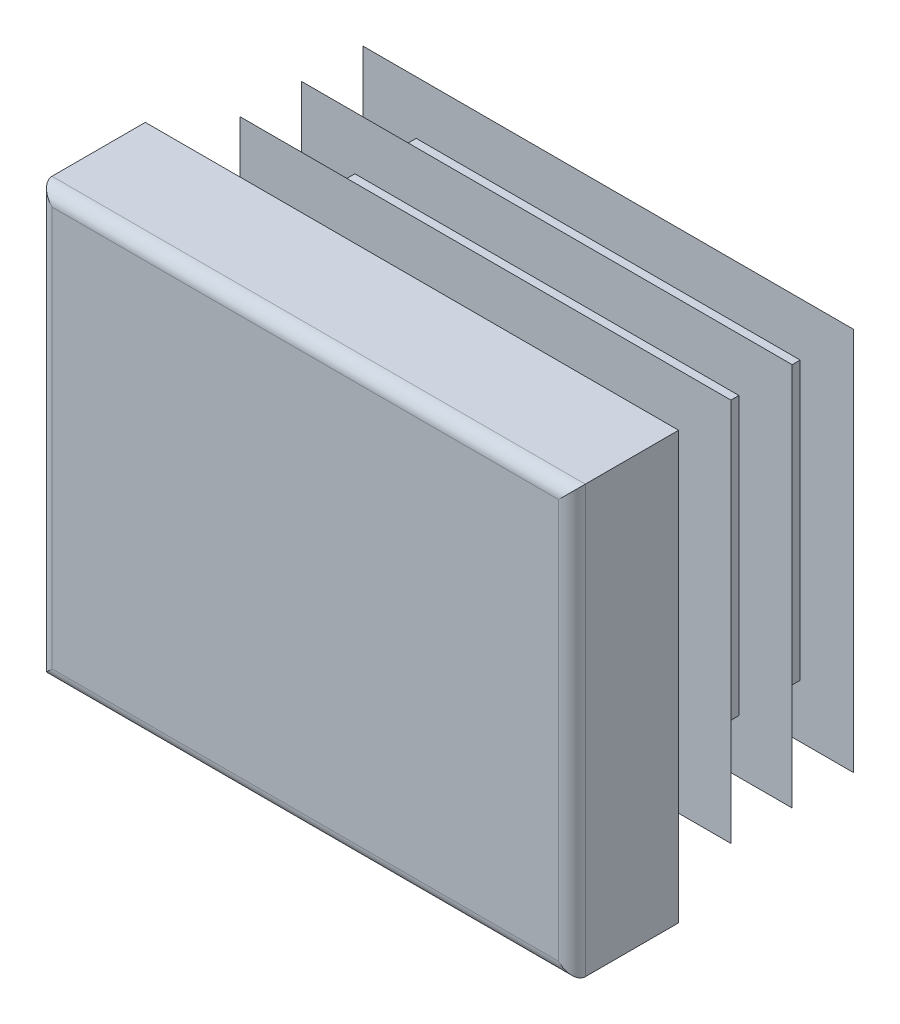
ISO-10303-21;
HEADER;
FILE_DESCRIPTION(('STEP AP214'),'2;1');
FILE_NAME('part.step','',(''),(''),'','','');
FILE_SCHEMA(('AUTOMOTIVE_DESIGN { 1 0 10303 214 1 1 1 1 }'));
ENDSEC;
DATA;
#1=APPLICATION_CONTEXT('core data for automotive mechanical design processes');
#2=APPLICATION_PROTOCOL_DEFINITION('international standard','automotive_design',2000,#1);
#3=PRODUCT_CONTEXT('',#1,'mechanical');
#4=PRODUCT('Part','Part','',(#3));
#5=PRODUCT_RELATED_PRODUCT_CATEGORY('part','',(#4));
#6=PRODUCT_DEFINITION_FORMATION('','',#4);
#7=PRODUCT_DEFINITION_CONTEXT('part definition',#1,'design');
#8=PRODUCT_DEFINITION('design','',#6,#7);
#9=PRODUCT_DEFINITION_SHAPE('','',#8);
#10=(LENGTH_UNIT() NAMED_UNIT(*) SI_UNIT(.MILLI.,.METRE.));
#11=(NAMED_UNIT(*) PLANE_ANGLE_UNIT() SI_UNIT($,.RADIAN.));
#12=(NAMED_UNIT(*) SI_UNIT($,.STERADIAN.) SOLID_ANGLE_UNIT());
#13=UNCERTAINTY_MEASURE_WITH_UNIT(LENGTH_MEASURE(1.E-05),#10,'distance_accuracy_value','');
#14=(GEOMETRIC_REPRESENTATION_CONTEXT(3) GLOBAL_UNCERTAINTY_ASSIGNED_CONTEXT((#13)) GLOBAL_UNIT_ASSIGNED_CONTEXT((#10,
#11,#12)) REPRESENTATION_CONTEXT('',''));
#15=CARTESIAN_POINT('',(0.,0.,0.));
#16=DIRECTION('',(0.,0.,1.));
#17=DIRECTION('',(1.,0.,0.));
#18=AXIS2_PLACEMENT_3D('',#15,#16,#17);
#19=CARTESIAN_POINT('',(11.875,-10.,5.));
#20=DIRECTION('',(0.,0.,-1.));
#21=DIRECTION('',(0.,1.,0.));
#22=AXIS2_PLACEMENT_3D('',#19,#20,#21);
#23=PLANE('',#22);
#24=DIRECTION('',(0.,1.,0.));
#25=VECTOR('',#24,1.);
#26=CARTESIAN_POINT('',(-11.875,-10.,5.));
#27=LINE('',#26,#25);
#28=CARTESIAN_POINT('',(-11.875,-9.375,5.));
#29=VERTEX_POINT('',#28);
#30=CARTESIAN_POINT('',(-11.875,9.375,5.));
#31=VERTEX_POINT('',#30);
#32=EDGE_CURVE('E310',#29,#31,#27,.T.);
#33=ORIENTED_EDGE('',*,*,#32,.F.);
#34=DIRECTION('',(-1.,0.,0.));
#35=VECTOR('',#34,1.);
#36=CARTESIAN_POINT('',(12.5,-9.375,5.));
#37=LINE('',#36,#35);
#38=CARTESIAN_POINT('',(11.875,-9.375,5.));
#39=VERTEX_POINT('',#38);
#40=EDGE_CURVE('E482',#39,#29,#37,.T.);
#41=ORIENTED_EDGE('',*,*,#40,.F.);
#42=DIRECTION('',(0.,1.,0.));
#43=VECTOR('',#42,1.);
#44=CARTESIAN_POINT('',(11.875,-10.,5.));
#45=LINE('',#44,#43);
#46=CARTESIAN_POINT('',(11.875,9.375,5.));
#47=VERTEX_POINT('',#46);
#48=EDGE_CURVE('E305',#39,#47,#45,.T.);
#49=ORIENTED_EDGE('',*,*,#48,.T.);
#50=DIRECTION('',(-1.,0.,0.));
#51=VECTOR('',#50,1.);
#52=CARTESIAN_POINT('',(12.5,9.375,5.));
#53=LINE('',#52,#51);
#54=EDGE_CURVE('E630',#47,#31,#53,.T.);
#55=ORIENTED_EDGE('',*,*,#54,.T.);
#56=EDGE_LOOP('',(#33,#41,#49,#55));
#57=FACE_BOUND('',#56,.T.);
#58=ADVANCED_FACE('F14',(#57),#23,.F.);
#59=CARTESIAN_POINT('',(-11.875,-10.,4.375));
#60=DIRECTION('',(0.,1.,0.));
#61=DIRECTION('',(-1.,0.,0.));
#62=AXIS2_PLACEMENT_3D('',#59,#60,#61);
#63=CYLINDRICAL_SURFACE('',#62,0.625);
#64=DIRECTION('',(0.,1.,0.));
#65=VECTOR('',#64,1.);
#66=CARTESIAN_POINT('',(-12.5,-10.,4.375));
#67=LINE('',#66,#65);
#68=CARTESIAN_POINT('',(-12.5,-10.,4.375));
#69=VERTEX_POINT('',#68);
#70=CARTESIAN_POINT('',(-12.5,10.,4.375));
#71=VERTEX_POINT('',#70);
#72=EDGE_CURVE('E402',#69,#71,#67,.T.);
#73=ORIENTED_EDGE('',*,*,#72,.F.);
#74=CARTESIAN_POINT('',(-11.875,-9.375,4.375));
#75=DIRECTION('',(-0.707106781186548,0.707106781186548,0.));
#76=DIRECTION('',(0.707106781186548,0.707106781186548,0.));
#77=AXIS2_PLACEMENT_3D('',#74,#75,#76);
#78=ELLIPSE('',#77,0.883883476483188,0.625);
#79=EDGE_CURVE('E59',#69,#29,#78,.T.);
#80=ORIENTED_EDGE('',*,*,#79,.T.);
#81=ORIENTED_EDGE('',*,*,#32,.T.);
#82=CARTESIAN_POINT('',(-11.875,9.375,4.375));
#83=DIRECTION('',(0.707106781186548,0.707106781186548,0.));
#84=DIRECTION('',(-0.707106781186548,0.707106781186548,0.));
#85=AXIS2_PLACEMENT_3D('',#82,#83,#84);
#86=ELLIPSE('',#85,0.883883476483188,0.625);
#87=EDGE_CURVE('E306',#31,#71,#86,.F.);
#88=ORIENTED_EDGE('',*,*,#87,.T.);
#89=EDGE_LOOP('',(#73,#80,#81,#88));
#90=FACE_BOUND('',#89,.T.);
#91=ADVANCED_FACE('F16',(#90),#63,.T.);
#92=CARTESIAN_POINT('',(-12.5,-10.,4.375));
#93=DIRECTION('',(1.,0.,0.));
#94=DIRECTION('',(0.,1.,0.));
#95=AXIS2_PLACEMENT_3D('',#92,#93,#94);
#96=PLANE('',#95);
#97=DIRECTION('',(0.,0.,-1.));
#98=VECTOR('',#97,1.);
#99=CARTESIAN_POINT('',(-12.5,10.,4.375));
#100=LINE('',#99,#98);
#101=CARTESIAN_POINT('',(-12.5,10.,0.));
#102=VERTEX_POINT('',#101);
#103=EDGE_CURVE('E615',#71,#102,#100,.T.);
#104=ORIENTED_EDGE('',*,*,#103,.T.);
#105=DIRECTION('',(0.,1.,0.));
#106=VECTOR('',#105,1.);
#107=CARTESIAN_POINT('',(-12.5,-10.,0.));
#108=LINE('',#107,#106);
#109=CARTESIAN_POINT('',(-12.5,-10.,0.));
#110=VERTEX_POINT('',#109);
#111=EDGE_CURVE('E400',#110,#102,#108,.T.);
#112=ORIENTED_EDGE('',*,*,#111,.F.);
#113=DIRECTION('',(0.,0.,-1.));
#114=VECTOR('',#113,1.);
#115=CARTESIAN_POINT('',(-12.5,-10.,4.375));
#116=LINE('',#115,#114);
#117=EDGE_CURVE('E616',#69,#110,#116,.T.);
#118=ORIENTED_EDGE('',*,*,#117,.F.);
#119=ORIENTED_EDGE('',*,*,#72,.T.);
#120=EDGE_LOOP('',(#104,#112,#118,#119));
#121=FACE_BOUND('',#120,.T.);
#122=ADVANCED_FACE('F697',(#121),#96,.F.);
#123=CARTESIAN_POINT('',(-9.,-10.,0.));
#124=DIRECTION('',(1.,0.,0.));
#125=DIRECTION('',(0.,1.,0.));
#126=AXIS2_PLACEMENT_3D('',#123,#124,#125);
#127=PLANE('',#126);
#128=DIRECTION('',(0.,1.,0.));
#129=VECTOR('',#128,1.);
#130=CARTESIAN_POINT('',(-9.,-10.,0.));
#131=LINE('',#130,#129);
#132=CARTESIAN_POINT('',(-9.,-6.5,0.));
#133=VERTEX_POINT('',#132);
#134=CARTESIAN_POINT('',(-9.,6.5,0.));
#135=VERTEX_POINT('',#134);
#136=EDGE_CURVE('E397',#133,#135,#131,.T.);
#137=ORIENTED_EDGE('',*,*,#136,.T.);
#138=DIRECTION('',(0.,0.,-1.));
#139=VECTOR('',#138,1.);
#140=CARTESIAN_POINT('',(-9.,6.5,0.));
#141=LINE('',#140,#139);
#142=CARTESIAN_POINT('',(-9.,6.5,-0.575));
#143=VERTEX_POINT('',#142);
#144=EDGE_CURVE('E495',#135,#143,#141,.T.);
#145=ORIENTED_EDGE('',*,*,#144,.T.);
#146=DIRECTION('',(0.,1.,0.));
#147=VECTOR('',#146,1.);
#148=CARTESIAN_POINT('',(-9.,-10.,-0.575));
#149=LINE('',#148,#147);
#150=CARTESIAN_POINT('',(-9.,-6.5,-0.575));
#151=VERTEX_POINT('',#150);
#152=EDGE_CURVE('E394',#151,#143,#149,.T.);
#153=ORIENTED_EDGE('',*,*,#152,.F.);
#154=DIRECTION('',(0.,0.,1.));
#155=VECTOR('',#154,1.);
#156=CARTESIAN_POINT('',(-9.,-6.5,0.));
#157=LINE('',#156,#155);
#158=EDGE_CURVE('E489',#151,#133,#157,.T.);
#159=ORIENTED_EDGE('',*,*,#158,.T.);
#160=EDGE_LOOP('',(#137,#145,#153,#159));
#161=FACE_BOUND('',#160,.T.);
#162=ADVANCED_FACE('F787',(#161),#127,.F.);
#163=CARTESIAN_POINT('',(-11.5,-10.,-0.575));
#164=DIRECTION('',(0.342020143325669,0.,0.939692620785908));
#165=DIRECTION('',(-0.939692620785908,0.,0.342020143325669));
#166=AXIS2_PLACEMENT_3D('',#163,#164,#165);
#167=PLANE('',#166);
#168=DIRECTION('',(0.,1.,0.));
#169=VECTOR('',#168,1.);
#170=CARTESIAN_POINT('',(-11.5,-10.,-0.575));
#171=LINE('',#170,#169);
#172=CARTESIAN_POINT('',(-11.5,-9.,-0.575));
#173=VERTEX_POINT('',#172);
#174=CARTESIAN_POINT('',(-11.5,9.,-0.575));
#175=VERTEX_POINT('',#174);
#176=EDGE_CURVE('E392',#173,#175,#171,.T.);
#177=ORIENTED_EDGE('',*,*,#176,.T.);
#178=DIRECTION('',(0.844349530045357,-0.438895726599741,-0.307318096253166));
#179=VECTOR('',#178,1.);
#180=CARTESIAN_POINT('',(-4.45895339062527,5.34004028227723,-3.13773138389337));
#181=LINE('',#180,#179);
#182=CARTESIAN_POINT('',(-9.,7.70049158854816,-1.48492558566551));
#183=VERTEX_POINT('',#182);
#184=EDGE_CURVE('E519',#175,#183,#181,.T.);
#185=ORIENTED_EDGE('',*,*,#184,.T.);
#186=DIRECTION('',(0.,1.,0.));
#187=VECTOR('',#186,1.);
#188=CARTESIAN_POINT('',(-9.,-10.,-1.48492558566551));
#189=LINE('',#188,#187);
#190=CARTESIAN_POINT('',(-9.,-7.70049158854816,-1.48492558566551));
#191=VERTEX_POINT('',#190);
#192=EDGE_CURVE('E389',#191,#183,#189,.T.);
#193=ORIENTED_EDGE('',*,*,#192,.F.);
#194=DIRECTION('',(-0.844349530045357,-0.438895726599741,0.307318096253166));
#195=VECTOR('',#194,1.);
#196=CARTESIAN_POINT('',(-11.8705814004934,-9.19262945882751,-0.440119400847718));
#197=LINE('',#196,#195);
#198=EDGE_CURVE('E507',#191,#173,#197,.T.);
#199=ORIENTED_EDGE('',*,*,#198,.T.);
#200=EDGE_LOOP('',(#177,#185,#193,#199));
#201=FACE_BOUND('',#200,.T.);
#202=ADVANCED_FACE('F783',(#201),#167,.F.);
#203=CARTESIAN_POINT('',(-9.,-10.,-1.48492558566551));
#204=DIRECTION('',(1.,0.,0.));
#205=DIRECTION('',(0.,1.,0.));
#206=AXIS2_PLACEMENT_3D('',#203,#204,#205);
#207=PLANE('',#206);
#208=ORIENTED_EDGE('',*,*,#192,.T.);
#209=DIRECTION('',(0.,-0.819152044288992,-0.573576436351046));
#210=VECTOR('',#209,1.);
#211=CARTESIAN_POINT('',(-9.,-4.17671654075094,-9.80143625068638));
#212=LINE('',#211,#210);
#213=CARTESIAN_POINT('',(-9.,6.5,-2.32551884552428));
#214=VERTEX_POINT('',#213);
#215=EDGE_CURVE('E516',#183,#214,#212,.T.);
#216=ORIENTED_EDGE('',*,*,#215,.T.);
#217=DIRECTION('',(0.,0.,-1.));
#218=VECTOR('',#217,1.);
#219=CARTESIAN_POINT('',(-9.,6.5,-1.48492558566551));
#220=LINE('',#219,#218);
#221=CARTESIAN_POINT('',(-9.,6.5,-3.45));
#222=VERTEX_POINT('',#221);
#223=EDGE_CURVE('E525',#214,#222,#220,.T.);
#224=ORIENTED_EDGE('',*,*,#223,.T.);
#225=DIRECTION('',(0.,1.,0.));
#226=VECTOR('',#225,1.);
#227=CARTESIAN_POINT('',(-9.,-10.,-3.45));
#228=LINE('',#227,#226);
#229=CARTESIAN_POINT('',(-9.,-6.5,-3.45));
#230=VERTEX_POINT('',#229);
#231=EDGE_CURVE('E386',#230,#222,#228,.T.);
#232=ORIENTED_EDGE('',*,*,#231,.F.);
#233=DIRECTION('',(0.,0.,1.));
#234=VECTOR('',#233,1.);
#235=CARTESIAN_POINT('',(-9.,-6.5,-1.48492558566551));
#236=LINE('',#235,#234);
#237=CARTESIAN_POINT('',(-9.,-6.5,-2.32551884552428));
#238=VERTEX_POINT('',#237);
#239=EDGE_CURVE('E522',#230,#238,#236,.T.);
#240=ORIENTED_EDGE('',*,*,#239,.T.);
#241=DIRECTION('',(0.,-0.819152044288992,0.573576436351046));
#242=VECTOR('',#241,1.);
#243=CARTESIAN_POINT('',(-9.,-9.24348489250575,-0.404510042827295));
#244=LINE('',#243,#242);
#245=EDGE_CURVE('E504',#238,#191,#244,.T.);
#246=ORIENTED_EDGE('',*,*,#245,.T.);
#247=EDGE_LOOP('',(#208,#216,#224,#232,#240,#246));
#248=FACE_BOUND('',#247,.T.);
#249=ADVANCED_FACE('F779',(#248),#207,.F.);
#250=CARTESIAN_POINT('',(-11.5,-10.,-3.45));
#251=DIRECTION('',(0.342020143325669,0.,0.939692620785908));
#252=DIRECTION('',(-0.939692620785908,0.,0.342020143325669));
#253=AXIS2_PLACEMENT_3D('',#250,#251,#252);
#254=PLANE('',#253);
#255=DIRECTION('',(0.,1.,0.));
#256=VECTOR('',#255,1.);
#257=CARTESIAN_POINT('',(-11.5,-10.,-3.45));
#258=LINE('',#257,#256);
#259=CARTESIAN_POINT('',(-11.5,-9.,-3.45));
#260=VERTEX_POINT('',#259);
#261=CARTESIAN_POINT('',(-11.5,9.,-3.45));
#262=VERTEX_POINT('',#261);
#263=EDGE_CURVE('E384',#260,#262,#258,.T.);
#264=ORIENTED_EDGE('',*,*,#263,.T.);
#265=DIRECTION('',(0.844349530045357,-0.438895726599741,-0.307318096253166));
#266=VECTOR('',#265,1.);
#267=CARTESIAN_POINT('',(-4.45895339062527,5.34004028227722,-6.01273138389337));
#268=LINE('',#267,#266);
#269=CARTESIAN_POINT('',(-9.,7.70049158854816,-4.35992558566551));
#270=VERTEX_POINT('',#269);
#271=EDGE_CURVE('E549',#262,#270,#268,.T.);
#272=ORIENTED_EDGE('',*,*,#271,.T.);
#273=DIRECTION('',(0.,1.,0.));
#274=VECTOR('',#273,1.);
#275=CARTESIAN_POINT('',(-9.,-10.,-4.35992558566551));
#276=LINE('',#275,#274);
#277=CARTESIAN_POINT('',(-9.,-7.70049158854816,-4.35992558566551));
#278=VERTEX_POINT('',#277);
#279=EDGE_CURVE('E381',#278,#270,#276,.T.);
#280=ORIENTED_EDGE('',*,*,#279,.F.);
#281=DIRECTION('',(-0.844349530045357,-0.43889572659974,0.307318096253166));
#282=VECTOR('',#281,1.);
#283=CARTESIAN_POINT('',(-11.8705814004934,-9.19262945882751,-3.31511940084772));
#284=LINE('',#283,#282);
#285=EDGE_CURVE('E537',#278,#260,#284,.T.);
#286=ORIENTED_EDGE('',*,*,#285,.T.);
#287=EDGE_LOOP('',(#264,#272,#280,#286));
#288=FACE_BOUND('',#287,.T.);
#289=ADVANCED_FACE('F775',(#288),#254,.F.);
#290=CARTESIAN_POINT('',(-9.,-10.,-4.35992558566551));
#291=DIRECTION('',(1.,0.,0.));
#292=DIRECTION('',(0.,1.,0.));
#293=AXIS2_PLACEMENT_3D('',#290,#291,#292);
#294=PLANE('',#293);
#295=ORIENTED_EDGE('',*,*,#279,.T.);
#296=DIRECTION('',(0.,-0.819152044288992,-0.573576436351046));
#297=VECTOR('',#296,1.);
#298=CARTESIAN_POINT('',(-9.,-4.17671654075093,-12.6764362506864));
#299=LINE('',#298,#297);
#300=CARTESIAN_POINT('',(-9.,6.5,-5.20051884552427));
#301=VERTEX_POINT('',#300);
#302=EDGE_CURVE('E546',#270,#301,#299,.T.);
#303=ORIENTED_EDGE('',*,*,#302,.T.);
#304=DIRECTION('',(0.,0.,-1.));
#305=VECTOR('',#304,1.);
#306=CARTESIAN_POINT('',(-9.,6.5,-4.35992558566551));
#307=LINE('',#306,#305);
#308=CARTESIAN_POINT('',(-9.,6.5,-6.325));
#309=VERTEX_POINT('',#308);
#310=EDGE_CURVE('E555',#301,#309,#307,.T.);
#311=ORIENTED_EDGE('',*,*,#310,.T.);
#312=DIRECTION('',(0.,1.,0.));
#313=VECTOR('',#312,1.);
#314=CARTESIAN_POINT('',(-9.,-10.,-6.325));
#315=LINE('',#314,#313);
#316=CARTESIAN_POINT('',(-9.,-6.5,-6.325));
#317=VERTEX_POINT('',#316);
#318=EDGE_CURVE('E378',#317,#309,#315,.T.);
#319=ORIENTED_EDGE('',*,*,#318,.F.);
#320=DIRECTION('',(0.,0.,1.));
#321=VECTOR('',#320,1.);
#322=CARTESIAN_POINT('',(-9.,-6.5,-4.35992558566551));
#323=LINE('',#322,#321);
#324=CARTESIAN_POINT('',(-9.,-6.5,-5.20051884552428));
#325=VERTEX_POINT('',#324);
#326=EDGE_CURVE('E552',#317,#325,#323,.T.);
#327=ORIENTED_EDGE('',*,*,#326,.T.);
#328=DIRECTION('',(0.,-0.819152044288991,0.573576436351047));
#329=VECTOR('',#328,1.);
#330=CARTESIAN_POINT('',(-9.,-9.24348489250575,-3.27951004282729));
#331=LINE('',#330,#329);
#332=EDGE_CURVE('E534',#325,#278,#331,.T.);
#333=ORIENTED_EDGE('',*,*,#332,.T.);
#334=EDGE_LOOP('',(#295,#303,#311,#319,#327,#333));
#335=FACE_BOUND('',#334,.T.);
#336=ADVANCED_FACE('F771',(#335),#294,.F.);
#337=CARTESIAN_POINT('',(-11.5,-10.,-6.325));
#338=DIRECTION('',(0.34202014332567,0.,0.939692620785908));
#339=DIRECTION('',(-0.939692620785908,0.,0.34202014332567));
#340=AXIS2_PLACEMENT_3D('',#337,#338,#339);
#341=PLANE('',#340);
#342=DIRECTION('',(0.,1.,0.));
#343=VECTOR('',#342,1.);
#344=CARTESIAN_POINT('',(-11.5,-10.,-6.325));
#345=LINE('',#344,#343);
#346=CARTESIAN_POINT('',(-11.5,-9.,-6.325));
#347=VERTEX_POINT('',#346);
#348=CARTESIAN_POINT('',(-11.5,9.,-6.325));
#349=VERTEX_POINT('',#348);
#350=EDGE_CURVE('E376',#347,#349,#345,.T.);
#351=ORIENTED_EDGE('',*,*,#350,.T.);
#352=DIRECTION('',(0.844349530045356,-0.438895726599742,-0.307318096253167));
#353=VECTOR('',#352,1.);
#354=CARTESIAN_POINT('',(-4.45895339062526,5.3400402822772,-8.88773138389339));
#355=LINE('',#354,#353);
#356=CARTESIAN_POINT('',(-9.,7.70049158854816,-7.23492558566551));
#357=VERTEX_POINT('',#356);
#358=EDGE_CURVE('E579',#349,#357,#355,.T.);
#359=ORIENTED_EDGE('',*,*,#358,.T.);
#360=DIRECTION('',(0.,1.,0.));
#361=VECTOR('',#360,1.);
#362=CARTESIAN_POINT('',(-9.,-10.,-7.23492558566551));
#363=LINE('',#362,#361);
#364=CARTESIAN_POINT('',(-9.,-7.70049158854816,-7.23492558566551));
#365=VERTEX_POINT('',#364);
#366=EDGE_CURVE('E373',#365,#357,#363,.T.);
#367=ORIENTED_EDGE('',*,*,#366,.F.);
#368=DIRECTION('',(-0.844349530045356,-0.438895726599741,0.307318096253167));
#369=VECTOR('',#368,1.);
#370=CARTESIAN_POINT('',(-11.8705814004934,-9.19262945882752,-6.19011940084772));
#371=LINE('',#370,#369);
#372=EDGE_CURVE('E567',#365,#347,#371,.T.);
#373=ORIENTED_EDGE('',*,*,#372,.T.);
#374=EDGE_LOOP('',(#351,#359,#367,#373));
#375=FACE_BOUND('',#374,.T.);
#376=ADVANCED_FACE('F767',(#375),#341,.F.);
#377=CARTESIAN_POINT('',(-9.,-10.,-7.23492558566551));
#378=DIRECTION('',(1.,0.,0.));
#379=DIRECTION('',(0.,1.,0.));
#380=AXIS2_PLACEMENT_3D('',#377,#378,#379);
#381=PLANE('',#380);
#382=ORIENTED_EDGE('',*,*,#366,.T.);
#383=DIRECTION('',(0.,-0.819152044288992,-0.573576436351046));
#384=VECTOR('',#383,1.);
#385=CARTESIAN_POINT('',(-9.,-4.17671654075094,-15.5514362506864));
#386=LINE('',#385,#384);
#387=CARTESIAN_POINT('',(-9.,6.5,-8.07551884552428));
#388=VERTEX_POINT('',#387);
#389=EDGE_CURVE('E576',#357,#388,#386,.T.);
#390=ORIENTED_EDGE('',*,*,#389,.T.);
#391=DIRECTION('',(0.,0.,-1.));
#392=VECTOR('',#391,1.);
#393=CARTESIAN_POINT('',(-9.,6.5,-7.23492558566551));
#394=LINE('',#393,#392);
#395=CARTESIAN_POINT('',(-9.,6.5,-9.2));
#396=VERTEX_POINT('',#395);
#397=EDGE_CURVE('E585',#388,#396,#394,.T.);
#398=ORIENTED_EDGE('',*,*,#397,.T.);
#399=DIRECTION('',(0.,1.,0.));
#400=VECTOR('',#399,1.);
#401=CARTESIAN_POINT('',(-9.,-10.,-9.2));
#402=LINE('',#401,#400);
#403=CARTESIAN_POINT('',(-9.,-6.5,-9.2));
#404=VERTEX_POINT('',#403);
#405=EDGE_CURVE('E370',#404,#396,#402,.T.);
#406=ORIENTED_EDGE('',*,*,#405,.F.);
#407=DIRECTION('',(0.,0.,1.));
#408=VECTOR('',#407,1.);
#409=CARTESIAN_POINT('',(-9.,-6.5,-7.23492558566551));
#410=LINE('',#409,#408);
#411=CARTESIAN_POINT('',(-9.,-6.5,-8.07551884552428));
#412=VERTEX_POINT('',#411);
#413=EDGE_CURVE('E582',#404,#412,#410,.T.);
#414=ORIENTED_EDGE('',*,*,#413,.T.);
#415=DIRECTION('',(0.,-0.819152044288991,0.573576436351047));
#416=VECTOR('',#415,1.);
#417=CARTESIAN_POINT('',(-9.,-9.24348489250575,-6.1545100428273));
#418=LINE('',#417,#416);
#419=EDGE_CURVE('E564',#412,#365,#418,.T.);
#420=ORIENTED_EDGE('',*,*,#419,.T.);
#421=EDGE_LOOP('',(#382,#390,#398,#406,#414,#420));
#422=FACE_BOUND('',#421,.T.);
#423=ADVANCED_FACE('F764',(#422),#381,.F.);
#424=CARTESIAN_POINT('',(-11.5,-10.,-9.2));
#425=DIRECTION('',(0.342020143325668,0.,0.939692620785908));
#426=DIRECTION('',(-0.939692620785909,0.,0.342020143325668));
#427=AXIS2_PLACEMENT_3D('',#424,#425,#426);
#428=PLANE('',#427);
#429=DIRECTION('',(0.,1.,0.));
#430=VECTOR('',#429,1.);
#431=CARTESIAN_POINT('',(-11.5,-10.,-9.2));
#432=LINE('',#431,#430);
#433=CARTESIAN_POINT('',(-11.5,-9.,-9.2));
#434=VERTEX_POINT('',#433);
#435=CARTESIAN_POINT('',(-11.5,9.,-9.2));
#436=VERTEX_POINT('',#435);
#437=EDGE_CURVE('E368',#434,#436,#432,.T.);
#438=ORIENTED_EDGE('',*,*,#437,.T.);
#439=DIRECTION('',(0.844349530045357,-0.438895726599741,-0.307318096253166));
#440=VECTOR('',#439,1.);
#441=CARTESIAN_POINT('',(-4.45895339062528,5.34004028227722,-11.7627313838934));
#442=LINE('',#441,#440);
#443=CARTESIAN_POINT('',(-9.,7.70049158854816,-10.1099255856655));
#444=VERTEX_POINT('',#443);
#445=EDGE_CURVE('E607',#436,#444,#442,.T.);
#446=ORIENTED_EDGE('',*,*,#445,.T.);
#447=DIRECTION('',(0.,1.,0.));
#448=VECTOR('',#447,1.);
#449=CARTESIAN_POINT('',(-9.,-10.,-10.1099255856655));
#450=LINE('',#449,#448);
#451=CARTESIAN_POINT('',(-9.,-7.70049158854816,-10.1099255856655));
#452=VERTEX_POINT('',#451);
#453=EDGE_CURVE('E365',#452,#444,#450,.T.);
#454=ORIENTED_EDGE('',*,*,#453,.F.);
#455=DIRECTION('',(-0.844349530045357,-0.43889572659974,0.307318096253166));
#456=VECTOR('',#455,1.);
#457=CARTESIAN_POINT('',(-11.8705814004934,-9.19262945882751,-9.06511940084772));
#458=LINE('',#457,#456);
#459=EDGE_CURVE('E595',#452,#434,#458,.T.);
#460=ORIENTED_EDGE('',*,*,#459,.T.);
#461=EDGE_LOOP('',(#438,#446,#454,#460));
#462=FACE_BOUND('',#461,.T.);
#463=ADVANCED_FACE('F675',(#462),#428,.F.);
#464=CARTESIAN_POINT('',(-9.,-10.,-10.1099255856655));
#465=DIRECTION('',(1.,0.,0.));
#466=DIRECTION('',(0.,1.,0.));
#467=AXIS2_PLACEMENT_3D('',#464,#465,#466);
#468=PLANE('',#467);
#469=ORIENTED_EDGE('',*,*,#453,.T.);
#470=DIRECTION('',(0.,-0.819152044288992,-0.573576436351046));
#471=VECTOR('',#470,1.);
#472=CARTESIAN_POINT('',(-9.,-4.17671654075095,-18.4264362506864));
#473=LINE('',#472,#471);
#474=CARTESIAN_POINT('',(-9.,6.5,-10.9505188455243));
#475=VERTEX_POINT('',#474);
#476=EDGE_CURVE('E604',#444,#475,#473,.T.);
#477=ORIENTED_EDGE('',*,*,#476,.T.);
#478=DIRECTION('',(0.,0.,-1.));
#479=VECTOR('',#478,1.);
#480=CARTESIAN_POINT('',(-9.,6.5,-10.1099255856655));
#481=LINE('',#480,#479);
#482=CARTESIAN_POINT('',(-9.,6.5,-11.5));
#483=VERTEX_POINT('',#482);
#484=EDGE_CURVE('E613',#475,#483,#481,.T.);
#485=ORIENTED_EDGE('',*,*,#484,.T.);
#486=DIRECTION('',(0.,1.,0.));
#487=VECTOR('',#486,1.);
#488=CARTESIAN_POINT('',(-9.,-10.,-11.5));
#489=LINE('',#488,#487);
#490=CARTESIAN_POINT('',(-9.,-6.5,-11.5));
#491=VERTEX_POINT('',#490);
#492=EDGE_CURVE('E362',#491,#483,#489,.T.);
#493=ORIENTED_EDGE('',*,*,#492,.F.);
#494=DIRECTION('',(0.,0.,1.));
#495=VECTOR('',#494,1.);
#496=CARTESIAN_POINT('',(-9.,-6.5,-10.1099255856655));
#497=LINE('',#496,#495);
#498=CARTESIAN_POINT('',(-9.,-6.5,-10.9505188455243));
#499=VERTEX_POINT('',#498);
#500=EDGE_CURVE('E610',#491,#499,#497,.T.);
#501=ORIENTED_EDGE('',*,*,#500,.T.);
#502=DIRECTION('',(0.,-0.819152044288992,0.573576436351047));
#503=VECTOR('',#502,1.);
#504=CARTESIAN_POINT('',(-9.,-9.24348489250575,-9.02951004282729));
#505=LINE('',#504,#503);
#506=EDGE_CURVE('E592',#499,#452,#505,.T.);
#507=ORIENTED_EDGE('',*,*,#506,.T.);
#508=EDGE_LOOP('',(#469,#477,#485,#493,#501,#507));
#509=FACE_BOUND('',#508,.T.);
#510=ADVANCED_FACE('F677',(#509),#468,.F.);
#511=CARTESIAN_POINT('',(-9.,-10.,-11.5));
#512=DIRECTION('',(0.,0.,1.));
#513=DIRECTION('',(0.,-1.,0.));
#514=AXIS2_PLACEMENT_3D('',#511,#512,#513);
#515=PLANE('',#514);
#516=ORIENTED_EDGE('',*,*,#492,.T.);
#517=DIRECTION('',(-1.,0.,0.));
#518=VECTOR('',#517,1.);
#519=CARTESIAN_POINT('',(12.5,6.5,-11.5));
#520=LINE('',#519,#518);
#521=CARTESIAN_POINT('',(9.,6.5,-11.5));
#522=VERTEX_POINT('',#521);
#523=EDGE_CURVE('E438',#522,#483,#520,.T.);
#524=ORIENTED_EDGE('',*,*,#523,.F.);
#525=DIRECTION('',(0.,1.,0.));
#526=VECTOR('',#525,1.);
#527=CARTESIAN_POINT('',(9.,-10.,-11.5));
#528=LINE('',#527,#526);
#529=CARTESIAN_POINT('',(9.,-6.5,-11.5));
#530=VERTEX_POINT('',#529);
#531=EDGE_CURVE('E359',#530,#522,#528,.T.);
#532=ORIENTED_EDGE('',*,*,#531,.F.);
#533=DIRECTION('',(-1.,0.,0.));
#534=VECTOR('',#533,1.);
#535=CARTESIAN_POINT('',(12.5,-6.5,-11.5));
#536=LINE('',#535,#534);
#537=EDGE_CURVE('E436',#530,#491,#536,.T.);
#538=ORIENTED_EDGE('',*,*,#537,.T.);
#539=EDGE_LOOP('',(#516,#524,#532,#538));
#540=FACE_BOUND('',#539,.T.);
#541=ADVANCED_FACE('F435',(#540),#515,.F.);
#542=CARTESIAN_POINT('',(9.,-10.,-11.5));
#543=DIRECTION('',(-1.,0.,0.));
#544=DIRECTION('',(0.,-1.,0.));
#545=AXIS2_PLACEMENT_3D('',#542,#543,#544);
#546=PLANE('',#545);
#547=DIRECTION('',(0.,0.,1.));
#548=VECTOR('',#547,1.);
#549=CARTESIAN_POINT('',(9.,6.5,-11.5));
#550=LINE('',#549,#548);
#551=CARTESIAN_POINT('',(9.,6.5,-10.9505188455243));
#552=VERTEX_POINT('',#551);
#553=EDGE_CURVE('E9',#522,#552,#550,.T.);
#554=ORIENTED_EDGE('',*,*,#553,.T.);
#555=DIRECTION('',(0.,0.819152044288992,0.573576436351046));
#556=VECTOR('',#555,1.);
#557=CARTESIAN_POINT('',(9.,-4.82983787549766,-18.8837567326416));
#558=LINE('',#557,#556);
#559=CARTESIAN_POINT('',(9.,7.70049158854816,-10.1099255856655));
#560=VERTEX_POINT('',#559);
#561=EDGE_CURVE('E601',#552,#560,#558,.T.);
#562=ORIENTED_EDGE('',*,*,#561,.T.);
#563=DIRECTION('',(0.,1.,0.));
#564=VECTOR('',#563,1.);
#565=CARTESIAN_POINT('',(9.,-10.,-10.1099255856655));
#566=LINE('',#565,#564);
#567=CARTESIAN_POINT('',(9.,-7.70049158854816,-10.1099255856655));
#568=VERTEX_POINT('',#567);
#569=EDGE_CURVE('E356',#568,#560,#566,.T.);
#570=ORIENTED_EDGE('',*,*,#569,.F.);
#571=DIRECTION('',(0.,0.819152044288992,-0.573576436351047));
#572=VECTOR('',#571,1.);
#573=CARTESIAN_POINT('',(9.,-8.59036355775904,-9.48683052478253));
#574=LINE('',#573,#572);
#575=CARTESIAN_POINT('',(9.,-6.5,-10.9505188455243));
#576=VERTEX_POINT('',#575);
#577=EDGE_CURVE('E428',#568,#576,#574,.T.);
#578=ORIENTED_EDGE('',*,*,#577,.T.);
#579=DIRECTION('',(0.,0.,-1.));
#580=VECTOR('',#579,1.);
#581=CARTESIAN_POINT('',(9.,-6.5,-11.5));
#582=LINE('',#581,#580);
#583=EDGE_CURVE('E23',#576,#530,#582,.T.);
#584=ORIENTED_EDGE('',*,*,#583,.T.);
#585=ORIENTED_EDGE('',*,*,#531,.T.);
#586=EDGE_LOOP('',(#554,#562,#570,#578,#584,#585));
#587=FACE_BOUND('',#586,.T.);
#588=ADVANCED_FACE('F426',(#587),#546,.F.);
#589=CARTESIAN_POINT('',(9.,-10.,-10.1099255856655));
#590=DIRECTION('',(-0.342020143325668,0.,0.939692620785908));
#591=DIRECTION('',(-0.939692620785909,0.,-0.342020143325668));
#592=AXIS2_PLACEMENT_3D('',#589,#590,#591);
#593=PLANE('',#592);
#594=ORIENTED_EDGE('',*,*,#569,.T.);
#595=DIRECTION('',(0.844349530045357,0.438895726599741,0.307318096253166));
#596=VECTOR('',#595,1.);
#597=CARTESIAN_POINT('',(2.44052703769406,4.29085547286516,-12.4973784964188));
#598=LINE('',#597,#596);
#599=CARTESIAN_POINT('',(11.5,9.,-9.2));
#600=VERTEX_POINT('',#599);
#601=EDGE_CURVE('E598',#560,#600,#598,.T.);
#602=ORIENTED_EDGE('',*,*,#601,.T.);
#603=DIRECTION('',(0.,1.,0.));
#604=VECTOR('',#603,1.);
#605=CARTESIAN_POINT('',(11.5,-10.,-9.2));
#606=LINE('',#605,#604);
#607=CARTESIAN_POINT('',(11.5,-9.,-9.2));
#608=VERTEX_POINT('',#607);
#609=EDGE_CURVE('E353',#608,#600,#606,.T.);
#610=ORIENTED_EDGE('',*,*,#609,.F.);
#611=DIRECTION('',(-0.844349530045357,0.43889572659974,-0.307318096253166));
#612=VECTOR('',#611,1.);
#613=CARTESIAN_POINT('',(9.85215504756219,-8.14344464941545,-9.79976651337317));
#614=LINE('',#613,#612);
#615=EDGE_CURVE('E588',#608,#568,#614,.T.);
#616=ORIENTED_EDGE('',*,*,#615,.T.);
#617=EDGE_LOOP('',(#594,#602,#610,#616));
#618=FACE_BOUND('',#617,.T.);
#619=ADVANCED_FACE('F752',(#618),#593,.F.);
#620=CARTESIAN_POINT('',(11.5,-10.,-9.2));
#621=DIRECTION('',(0.,0.,-1.));
#622=DIRECTION('',(0.,1.,0.));
#623=AXIS2_PLACEMENT_3D('',#620,#621,#622);
#624=PLANE('',#623);
#625=ORIENTED_EDGE('',*,*,#609,.T.);
#626=DIRECTION('',(-1.,0.,0.));
#627=VECTOR('',#626,1.);
#628=CARTESIAN_POINT('',(12.5,9.,-9.2));
#629=LINE('',#628,#627);
#630=EDGE_CURVE('E444',#600,#436,#629,.T.);
#631=ORIENTED_EDGE('',*,*,#630,.T.);
#632=ORIENTED_EDGE('',*,*,#437,.F.);
#633=DIRECTION('',(-1.,0.,0.));
#634=VECTOR('',#633,1.);
#635=CARTESIAN_POINT('',(12.5,-9.,-9.2));
#636=LINE('',#635,#634);
#637=EDGE_CURVE('E451',#608,#434,#636,.T.);
#638=ORIENTED_EDGE('',*,*,#637,.F.);
#639=EDGE_LOOP('',(#625,#631,#632,#638));
#640=FACE_BOUND('',#639,.T.);
#641=ORIENTED_EDGE('',*,*,#405,.T.);
#642=DIRECTION('',(-1.,0.,0.));
#643=VECTOR('',#642,1.);
#644=CARTESIAN_POINT('',(12.5,6.5,-9.2));
#645=LINE('',#644,#643);
#646=CARTESIAN_POINT('',(9.,6.5,-9.2));
#647=VERTEX_POINT('',#646);
#648=EDGE_CURVE('E663',#647,#396,#645,.T.);
#649=ORIENTED_EDGE('',*,*,#648,.F.);
#650=DIRECTION('',(0.,1.,0.));
#651=VECTOR('',#650,1.);
#652=CARTESIAN_POINT('',(9.,-10.,-9.2));
#653=LINE('',#652,#651);
#654=CARTESIAN_POINT('',(9.,-6.5,-9.2));
#655=VERTEX_POINT('',#654);
#656=EDGE_CURVE('E350',#655,#647,#653,.T.);
#657=ORIENTED_EDGE('',*,*,#656,.F.);
#658=DIRECTION('',(-1.,0.,0.));
#659=VECTOR('',#658,1.);
#660=CARTESIAN_POINT('',(12.5,-6.5,-9.2));
#661=LINE('',#660,#659);
#662=EDGE_CURVE('E453',#655,#404,#661,.T.);
#663=ORIENTED_EDGE('',*,*,#662,.T.);
#664=EDGE_LOOP('',(#641,#649,#657,#663));
#665=FACE_BOUND('',#664,.T.);
#666=ADVANCED_FACE('F667',(#640,#665),#624,.F.);
#667=CARTESIAN_POINT('',(9.,-10.,-9.2));
#668=DIRECTION('',(-1.,0.,0.));
#669=DIRECTION('',(0.,-1.,0.));
#670=AXIS2_PLACEMENT_3D('',#667,#668,#669);
#671=PLANE('',#670);
#672=DIRECTION('',(0.,0.,1.));
#673=VECTOR('',#672,1.);
#674=CARTESIAN_POINT('',(9.,6.5,-9.2));
#675=LINE('',#674,#673);
#676=CARTESIAN_POINT('',(9.,6.5,-8.07551884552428));
#677=VERTEX_POINT('',#676);
#678=EDGE_CURVE('E420',#647,#677,#675,.T.);
#679=ORIENTED_EDGE('',*,*,#678,.T.);
#680=DIRECTION('',(0.,0.819152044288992,0.573576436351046));
#681=VECTOR('',#680,1.);
#682=CARTESIAN_POINT('',(9.,-5.0999995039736,-16.1979259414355));
#683=LINE('',#682,#681);
#684=CARTESIAN_POINT('',(9.,7.70049158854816,-7.23492558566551));
#685=VERTEX_POINT('',#684);
#686=EDGE_CURVE('E573',#677,#685,#683,.T.);
#687=ORIENTED_EDGE('',*,*,#686,.T.);
#688=DIRECTION('',(0.,1.,0.));
#689=VECTOR('',#688,1.);
#690=CARTESIAN_POINT('',(9.,-10.,-7.23492558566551));
#691=LINE('',#690,#689);
#692=CARTESIAN_POINT('',(9.,-7.70049158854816,-7.23492558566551));
#693=VERTEX_POINT('',#692);
#694=EDGE_CURVE('E347',#693,#685,#691,.T.);
#695=ORIENTED_EDGE('',*,*,#694,.F.);
#696=DIRECTION('',(0.,0.819152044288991,-0.573576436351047));
#697=VECTOR('',#696,1.);
#698=CARTESIAN_POINT('',(9.,-8.32020192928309,-6.8009997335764));
#699=LINE('',#698,#697);
#700=CARTESIAN_POINT('',(9.,-6.5,-8.07551884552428));
#701=VERTEX_POINT('',#700);
#702=EDGE_CURVE('E561',#693,#701,#699,.T.);
#703=ORIENTED_EDGE('',*,*,#702,.T.);
#704=DIRECTION('',(0.,0.,-1.));
#705=VECTOR('',#704,1.);
#706=CARTESIAN_POINT('',(9.,-6.5,-9.2));
#707=LINE('',#706,#705);
#708=EDGE_CURVE('E417',#701,#655,#707,.T.);
#709=ORIENTED_EDGE('',*,*,#708,.T.);
#710=ORIENTED_EDGE('',*,*,#656,.T.);
#711=EDGE_LOOP('',(#679,#687,#695,#703,#709,#710));
#712=FACE_BOUND('',#711,.T.);
#713=ADVANCED_FACE('F745',(#712),#671,.F.);
#714=CARTESIAN_POINT('',(9.,-10.,-7.23492558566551));
#715=DIRECTION('',(-0.342020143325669,0.,0.939692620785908));
#716=DIRECTION('',(-0.939692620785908,0.,-0.342020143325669));
#717=AXIS2_PLACEMENT_3D('',#714,#715,#716);
#718=PLANE('',#717);
#719=ORIENTED_EDGE('',*,*,#694,.T.);
#720=DIRECTION('',(0.844349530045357,0.438895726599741,0.307318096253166));
#721=VECTOR('',#720,1.);
#722=CARTESIAN_POINT('',(2.44052703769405,4.29085547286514,-9.62237849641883));
#723=LINE('',#722,#721);
#724=CARTESIAN_POINT('',(11.5,9.,-6.325));
#725=VERTEX_POINT('',#724);
#726=EDGE_CURVE('E570',#685,#725,#723,.T.);
#727=ORIENTED_EDGE('',*,*,#726,.T.);
#728=DIRECTION('',(0.,1.,0.));
#729=VECTOR('',#728,1.);
#730=CARTESIAN_POINT('',(11.5,-10.,-6.325));
#731=LINE('',#730,#729);
#732=CARTESIAN_POINT('',(11.5,-9.,-6.325));
#733=VERTEX_POINT('',#732);
#734=EDGE_CURVE('E344',#733,#725,#731,.T.);
#735=ORIENTED_EDGE('',*,*,#734,.F.);
#736=DIRECTION('',(-0.844349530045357,0.43889572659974,-0.307318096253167));
#737=VECTOR('',#736,1.);
#738=CARTESIAN_POINT('',(9.85215504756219,-8.14344464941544,-6.92476651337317));
#739=LINE('',#738,#737);
#740=EDGE_CURVE('E558',#733,#693,#739,.T.);
#741=ORIENTED_EDGE('',*,*,#740,.T.);
#742=EDGE_LOOP('',(#719,#727,#735,#741));
#743=FACE_BOUND('',#742,.T.);
#744=ADVANCED_FACE('F741',(#743),#718,.F.);
#745=CARTESIAN_POINT('',(11.5,-10.,-6.325));
#746=DIRECTION('',(0.,0.,-1.));
#747=DIRECTION('',(0.,1.,0.));
#748=AXIS2_PLACEMENT_3D('',#745,#746,#747);
#749=PLANE('',#748);
#750=ORIENTED_EDGE('',*,*,#734,.T.);
#751=DIRECTION('',(-1.,0.,0.));
#752=VECTOR('',#751,1.);
#753=CARTESIAN_POINT('',(12.5,9.,-6.325));
#754=LINE('',#753,#752);
#755=EDGE_CURVE('E657',#725,#349,#754,.T.);
#756=ORIENTED_EDGE('',*,*,#755,.T.);
#757=ORIENTED_EDGE('',*,*,#350,.F.);
#758=DIRECTION('',(-1.,0.,0.));
#759=VECTOR('',#758,1.);
#760=CARTESIAN_POINT('',(12.5,-9.,-6.325));
#761=LINE('',#760,#759);
#762=EDGE_CURVE('E459',#733,#347,#761,.T.);
#763=ORIENTED_EDGE('',*,*,#762,.F.);
#764=EDGE_LOOP('',(#750,#756,#757,#763));
#765=FACE_BOUND('',#764,.T.);
#766=ORIENTED_EDGE('',*,*,#318,.T.);
#767=DIRECTION('',(-1.,0.,0.));
#768=VECTOR('',#767,1.);
#769=CARTESIAN_POINT('',(12.5,6.5,-6.325));
#770=LINE('',#769,#768);
#771=CARTESIAN_POINT('',(9.,6.5,-6.325));
#772=VERTEX_POINT('',#771);
#773=EDGE_CURVE('E655',#772,#309,#770,.T.);
#774=ORIENTED_EDGE('',*,*,#773,.F.);
#775=DIRECTION('',(0.,1.,0.));
#776=VECTOR('',#775,1.);
#777=CARTESIAN_POINT('',(9.,-10.,-6.325));
#778=LINE('',#777,#776);
#779=CARTESIAN_POINT('',(9.,-6.5,-6.325));
#780=VERTEX_POINT('',#779);
#781=EDGE_CURVE('E341',#780,#772,#778,.T.);
#782=ORIENTED_EDGE('',*,*,#781,.F.);
#783=DIRECTION('',(-1.,0.,0.));
#784=VECTOR('',#783,1.);
#785=CARTESIAN_POINT('',(12.5,-6.5,-6.325));
#786=LINE('',#785,#784);
#787=EDGE_CURVE('E461',#780,#317,#786,.T.);
#788=ORIENTED_EDGE('',*,*,#787,.T.);
#789=EDGE_LOOP('',(#766,#774,#782,#788));
#790=FACE_BOUND('',#789,.T.);
#791=ADVANCED_FACE('F737',(#765,#790),#749,.F.);
#792=CARTESIAN_POINT('',(9.,-10.,-6.325));
#793=DIRECTION('',(-1.,0.,0.));
#794=DIRECTION('',(0.,-1.,0.));
#795=AXIS2_PLACEMENT_3D('',#792,#793,#794);
#796=PLANE('',#795);
#797=DIRECTION('',(0.,0.,1.));
#798=VECTOR('',#797,1.);
#799=CARTESIAN_POINT('',(9.,6.5,-6.325));
#800=LINE('',#799,#798);
#801=CARTESIAN_POINT('',(9.,6.5,-5.20051884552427));
#802=VERTEX_POINT('',#801);
#803=EDGE_CURVE('E414',#772,#802,#800,.T.);
#804=ORIENTED_EDGE('',*,*,#803,.T.);
#805=DIRECTION('',(0.,0.819152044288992,0.573576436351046));
#806=VECTOR('',#805,1.);
#807=CARTESIAN_POINT('',(9.,-5.0999995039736,-13.3229259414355));
#808=LINE('',#807,#806);
#809=CARTESIAN_POINT('',(9.,7.70049158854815,-4.35992558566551));
#810=VERTEX_POINT('',#809);
#811=EDGE_CURVE('E543',#802,#810,#808,.T.);
#812=ORIENTED_EDGE('',*,*,#811,.T.);
#813=DIRECTION('',(0.,1.,0.));
#814=VECTOR('',#813,1.);
#815=CARTESIAN_POINT('',(9.,-10.,-4.35992558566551));
#816=LINE('',#815,#814);
#817=CARTESIAN_POINT('',(9.,-7.70049158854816,-4.35992558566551));
#818=VERTEX_POINT('',#817);
#819=EDGE_CURVE('E338',#818,#810,#816,.T.);
#820=ORIENTED_EDGE('',*,*,#819,.F.);
#821=DIRECTION('',(0.,0.819152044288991,-0.573576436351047));
#822=VECTOR('',#821,1.);
#823=CARTESIAN_POINT('',(9.,-8.32020192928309,-3.9259997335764));
#824=LINE('',#823,#822);
#825=CARTESIAN_POINT('',(9.,-6.5,-5.20051884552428));
#826=VERTEX_POINT('',#825);
#827=EDGE_CURVE('E531',#818,#826,#824,.T.);
#828=ORIENTED_EDGE('',*,*,#827,.T.);
#829=DIRECTION('',(0.,0.,-1.));
#830=VECTOR('',#829,1.);
#831=CARTESIAN_POINT('',(9.,-6.5,-6.325));
#832=LINE('',#831,#830);
#833=EDGE_CURVE('E411',#826,#780,#832,.T.);
#834=ORIENTED_EDGE('',*,*,#833,.T.);
#835=ORIENTED_EDGE('',*,*,#781,.T.);
#836=EDGE_LOOP('',(#804,#812,#820,#828,#834,#835));
#837=FACE_BOUND('',#836,.T.);
#838=ADVANCED_FACE('F733',(#837),#796,.F.);
#839=CARTESIAN_POINT('',(9.,-10.,-4.35992558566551));
#840=DIRECTION('',(-0.342020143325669,0.,0.939692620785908));
#841=DIRECTION('',(-0.939692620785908,0.,-0.342020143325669));
#842=AXIS2_PLACEMENT_3D('',#839,#840,#841);
#843=PLANE('',#842);
#844=ORIENTED_EDGE('',*,*,#819,.T.);
#845=DIRECTION('',(0.844349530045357,0.438895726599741,0.307318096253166));
#846=VECTOR('',#845,1.);
#847=CARTESIAN_POINT('',(2.44052703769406,4.29085547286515,-6.74737849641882));
#848=LINE('',#847,#846);
#849=CARTESIAN_POINT('',(11.5,9.,-3.45));
#850=VERTEX_POINT('',#849);
#851=EDGE_CURVE('E540',#810,#850,#848,.T.);
#852=ORIENTED_EDGE('',*,*,#851,.T.);
#853=DIRECTION('',(0.,1.,0.));
#854=VECTOR('',#853,1.);
#855=CARTESIAN_POINT('',(11.5,-10.,-3.45));
#856=LINE('',#855,#854);
#857=CARTESIAN_POINT('',(11.5,-9.,-3.45));
#858=VERTEX_POINT('',#857);
#859=EDGE_CURVE('E335',#858,#850,#856,.T.);
#860=ORIENTED_EDGE('',*,*,#859,.F.);
#861=DIRECTION('',(-0.844349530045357,0.43889572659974,-0.307318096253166));
#862=VECTOR('',#861,1.);
#863=CARTESIAN_POINT('',(9.85215504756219,-8.14344464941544,-4.04976651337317));
#864=LINE('',#863,#862);
#865=EDGE_CURVE('E528',#858,#818,#864,.T.);
#866=ORIENTED_EDGE('',*,*,#865,.T.);
#867=EDGE_LOOP('',(#844,#852,#860,#866));
#868=FACE_BOUND('',#867,.T.);
#869=ADVANCED_FACE('F729',(#868),#843,.F.);
#870=CARTESIAN_POINT('',(11.5,-10.,-3.45));
#871=DIRECTION('',(0.,0.,-1.));
#872=DIRECTION('',(0.,1.,0.));
#873=AXIS2_PLACEMENT_3D('',#870,#871,#872);
#874=PLANE('',#873);
#875=ORIENTED_EDGE('',*,*,#859,.T.);
#876=DIRECTION('',(-1.,0.,0.));
#877=VECTOR('',#876,1.);
#878=CARTESIAN_POINT('',(12.5,9.,-3.45));
#879=LINE('',#878,#877);
#880=EDGE_CURVE('E649',#850,#262,#879,.T.);
#881=ORIENTED_EDGE('',*,*,#880,.T.);
#882=ORIENTED_EDGE('',*,*,#263,.F.);
#883=DIRECTION('',(-1.,0.,0.));
#884=VECTOR('',#883,1.);
#885=CARTESIAN_POINT('',(12.5,-9.,-3.45));
#886=LINE('',#885,#884);
#887=EDGE_CURVE('E467',#858,#260,#886,.T.);
#888=ORIENTED_EDGE('',*,*,#887,.F.);
#889=EDGE_LOOP('',(#875,#881,#882,#888));
#890=FACE_BOUND('',#889,.T.);
#891=ORIENTED_EDGE('',*,*,#231,.T.);
#892=DIRECTION('',(-1.,0.,0.));
#893=VECTOR('',#892,1.);
#894=CARTESIAN_POINT('',(12.5,6.5,-3.45));
#895=LINE('',#894,#893);
#896=CARTESIAN_POINT('',(9.,6.5,-3.45));
#897=VERTEX_POINT('',#896);
#898=EDGE_CURVE('E647',#897,#222,#895,.T.);
#899=ORIENTED_EDGE('',*,*,#898,.F.);
#900=DIRECTION('',(0.,1.,0.));
#901=VECTOR('',#900,1.);
#902=CARTESIAN_POINT('',(9.,-10.,-3.45));
#903=LINE('',#902,#901);
#904=CARTESIAN_POINT('',(9.,-6.5,-3.45));
#905=VERTEX_POINT('',#904);
#906=EDGE_CURVE('E332',#905,#897,#903,.T.);
#907=ORIENTED_EDGE('',*,*,#906,.F.);
#908=DIRECTION('',(-1.,0.,0.));
#909=VECTOR('',#908,1.);
#910=CARTESIAN_POINT('',(12.5,-6.5,-3.45));
#911=LINE('',#910,#909);
#912=EDGE_CURVE('E469',#905,#230,#911,.T.);
#913=ORIENTED_EDGE('',*,*,#912,.T.);
#914=EDGE_LOOP('',(#891,#899,#907,#913));
#915=FACE_BOUND('',#914,.T.);
#916=ADVANCED_FACE('F725',(#890,#915),#874,.F.);
#917=CARTESIAN_POINT('',(9.,-10.,-3.45));
#918=DIRECTION('',(-1.,0.,0.));
#919=DIRECTION('',(0.,-1.,0.));
#920=AXIS2_PLACEMENT_3D('',#917,#918,#919);
#921=PLANE('',#920);
#922=DIRECTION('',(0.,0.,1.));
#923=VECTOR('',#922,1.);
#924=CARTESIAN_POINT('',(9.,6.5,-3.45));
#925=LINE('',#924,#923);
#926=CARTESIAN_POINT('',(9.,6.5,-2.32551884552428));
#927=VERTEX_POINT('',#926);
#928=EDGE_CURVE('E408',#897,#927,#925,.T.);
#929=ORIENTED_EDGE('',*,*,#928,.T.);
#930=DIRECTION('',(0.,0.819152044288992,0.573576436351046));
#931=VECTOR('',#930,1.);
#932=CARTESIAN_POINT('',(9.,-5.0999995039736,-10.4479259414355));
#933=LINE('',#932,#931);
#934=CARTESIAN_POINT('',(9.,7.70049158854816,-1.48492558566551));
#935=VERTEX_POINT('',#934);
#936=EDGE_CURVE('E513',#927,#935,#933,.T.);
#937=ORIENTED_EDGE('',*,*,#936,.T.);
#938=DIRECTION('',(0.,1.,0.));
#939=VECTOR('',#938,1.);
#940=CARTESIAN_POINT('',(9.,-10.,-1.48492558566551));
#941=LINE('',#940,#939);
#942=CARTESIAN_POINT('',(9.,-7.70049158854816,-1.48492558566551));
#943=VERTEX_POINT('',#942);
#944=EDGE_CURVE('E329',#943,#935,#941,.T.);
#945=ORIENTED_EDGE('',*,*,#944,.F.);
#946=DIRECTION('',(0.,0.819152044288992,-0.573576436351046));
#947=VECTOR('',#946,1.);
#948=CARTESIAN_POINT('',(9.,-8.32020192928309,-1.0509997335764));
#949=LINE('',#948,#947);
#950=CARTESIAN_POINT('',(9.,-6.5,-2.32551884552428));
#951=VERTEX_POINT('',#950);
#952=EDGE_CURVE('E501',#943,#951,#949,.T.);
#953=ORIENTED_EDGE('',*,*,#952,.T.);
#954=DIRECTION('',(0.,0.,-1.));
#955=VECTOR('',#954,1.);
#956=CARTESIAN_POINT('',(9.,-6.5,-3.45));
#957=LINE('',#956,#955);
#958=EDGE_CURVE('E405',#951,#905,#957,.T.);
#959=ORIENTED_EDGE('',*,*,#958,.T.);
#960=ORIENTED_EDGE('',*,*,#906,.T.);
#961=EDGE_LOOP('',(#929,#937,#945,#953,#959,#960));
#962=FACE_BOUND('',#961,.T.);
#963=ADVANCED_FACE('F721',(#962),#921,.F.);
#964=CARTESIAN_POINT('',(9.,-10.,-1.48492558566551));
#965=DIRECTION('',(-0.342020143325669,0.,0.939692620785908));
#966=DIRECTION('',(-0.939692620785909,0.,-0.342020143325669));
#967=AXIS2_PLACEMENT_3D('',#964,#965,#966);
#968=PLANE('',#967);
#969=ORIENTED_EDGE('',*,*,#944,.T.);
#970=DIRECTION('',(0.844349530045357,0.438895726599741,0.307318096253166));
#971=VECTOR('',#970,1.);
#972=CARTESIAN_POINT('',(2.44052703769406,4.29085547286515,-3.87237849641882));
#973=LINE('',#972,#971);
#974=CARTESIAN_POINT('',(11.5,9.,-0.575));
#975=VERTEX_POINT('',#974);
#976=EDGE_CURVE('E510',#935,#975,#973,.T.);
#977=ORIENTED_EDGE('',*,*,#976,.T.);
#978=DIRECTION('',(0.,1.,0.));
#979=VECTOR('',#978,1.);
#980=CARTESIAN_POINT('',(11.5,-10.,-0.575));
#981=LINE('',#980,#979);
#982=CARTESIAN_POINT('',(11.5,-9.,-0.575));
#983=VERTEX_POINT('',#982);
#984=EDGE_CURVE('E326',#983,#975,#981,.T.);
#985=ORIENTED_EDGE('',*,*,#984,.F.);
#986=DIRECTION('',(-0.844349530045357,0.438895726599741,-0.307318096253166));
#987=VECTOR('',#986,1.);
#988=CARTESIAN_POINT('',(9.85215504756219,-8.14344464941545,-1.17476651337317));
#989=LINE('',#988,#987);
#990=EDGE_CURVE('E498',#983,#943,#989,.T.);
#991=ORIENTED_EDGE('',*,*,#990,.T.);
#992=EDGE_LOOP('',(#969,#977,#985,#991));
#993=FACE_BOUND('',#992,.T.);
#994=ADVANCED_FACE('F717',(#993),#968,.F.);
#995=CARTESIAN_POINT('',(11.5,-10.,-0.575));
#996=DIRECTION('',(0.,0.,-1.));
#997=DIRECTION('',(0.,1.,0.));
#998=AXIS2_PLACEMENT_3D('',#995,#996,#997);
#999=PLANE('',#998);
#1000=ORIENTED_EDGE('',*,*,#984,.T.);
#1001=DIRECTION('',(-1.,0.,0.));
#1002=VECTOR('',#1001,1.);
#1003=CARTESIAN_POINT('',(12.5,9.,-0.575));
#1004=LINE('',#1003,#1002);
#1005=EDGE_CURVE('E641',#975,#175,#1004,.T.);
#1006=ORIENTED_EDGE('',*,*,#1005,.T.);
#1007=ORIENTED_EDGE('',*,*,#176,.F.);
#1008=DIRECTION('',(-1.,0.,0.));
#1009=VECTOR('',#1008,1.);
#1010=CARTESIAN_POINT('',(12.5,-9.,-0.575));
#1011=LINE('',#1010,#1009);
#1012=EDGE_CURVE('E475',#983,#173,#1011,.T.);
#1013=ORIENTED_EDGE('',*,*,#1012,.F.);
#1014=EDGE_LOOP('',(#1000,#1006,#1007,#1013));
#1015=FACE_BOUND('',#1014,.T.);
#1016=ORIENTED_EDGE('',*,*,#152,.T.);
#1017=DIRECTION('',(-1.,0.,0.));
#1018=VECTOR('',#1017,1.);
#1019=CARTESIAN_POINT('',(12.5,6.5,-0.575));
#1020=LINE('',#1019,#1018);
#1021=CARTESIAN_POINT('',(9.,6.5,-0.575));
#1022=VERTEX_POINT('',#1021);
#1023=EDGE_CURVE('E639',#1022,#143,#1020,.T.);
#1024=ORIENTED_EDGE('',*,*,#1023,.F.);
#1025=DIRECTION('',(0.,1.,0.));
#1026=VECTOR('',#1025,1.);
#1027=CARTESIAN_POINT('',(9.,-10.,-0.575));
#1028=LINE('',#1027,#1026);
#1029=CARTESIAN_POINT('',(9.,-6.5,-0.575));
#1030=VERTEX_POINT('',#1029);
#1031=EDGE_CURVE('E323',#1030,#1022,#1028,.T.);
#1032=ORIENTED_EDGE('',*,*,#1031,.F.);
#1033=DIRECTION('',(-1.,0.,0.));
#1034=VECTOR('',#1033,1.);
#1035=CARTESIAN_POINT('',(12.5,-6.5,-0.575));
#1036=LINE('',#1035,#1034);
#1037=EDGE_CURVE('E477',#1030,#151,#1036,.T.);
#1038=ORIENTED_EDGE('',*,*,#1037,.T.);
#1039=EDGE_LOOP('',(#1016,#1024,#1032,#1038));
#1040=FACE_BOUND('',#1039,.T.);
#1041=ADVANCED_FACE('F713',(#1015,#1040),#999,.F.);
#1042=CARTESIAN_POINT('',(9.,-10.,-0.575));
#1043=DIRECTION('',(-1.,0.,0.));
#1044=DIRECTION('',(0.,-1.,0.));
#1045=AXIS2_PLACEMENT_3D('',#1042,#1043,#1044);
#1046=PLANE('',#1045);
#1047=ORIENTED_EDGE('',*,*,#1031,.T.);
#1048=DIRECTION('',(0.,0.,1.));
#1049=VECTOR('',#1048,1.);
#1050=CARTESIAN_POINT('',(9.,6.5,-0.575));
#1051=LINE('',#1050,#1049);
#1052=CARTESIAN_POINT('',(9.,6.5,0.));
#1053=VERTEX_POINT('',#1052);
#1054=EDGE_CURVE('E492',#1022,#1053,#1051,.T.);
#1055=ORIENTED_EDGE('',*,*,#1054,.T.);
#1056=DIRECTION('',(0.,1.,0.));
#1057=VECTOR('',#1056,1.);
#1058=CARTESIAN_POINT('',(9.,-10.,0.));
#1059=LINE('',#1058,#1057);
#1060=CARTESIAN_POINT('',(9.,-6.5,0.));
#1061=VERTEX_POINT('',#1060);
#1062=EDGE_CURVE('E316',#1061,#1053,#1059,.T.);
#1063=ORIENTED_EDGE('',*,*,#1062,.F.);
#1064=DIRECTION('',(0.,0.,-1.));
#1065=VECTOR('',#1064,1.);
#1066=CARTESIAN_POINT('',(9.,-6.5,-0.575));
#1067=LINE('',#1066,#1065);
#1068=EDGE_CURVE('E486',#1061,#1030,#1067,.T.);
#1069=ORIENTED_EDGE('',*,*,#1068,.T.);
#1070=EDGE_LOOP('',(#1047,#1055,#1063,#1069));
#1071=FACE_BOUND('',#1070,.T.);
#1072=ADVANCED_FACE('F709',(#1071),#1046,.F.);
#1073=CARTESIAN_POINT('',(9.,-10.,0.));
#1074=DIRECTION('',(0.,0.,1.));
#1075=DIRECTION('',(0.,-1.,0.));
#1076=AXIS2_PLACEMENT_3D('',#1073,#1074,#1075);
#1077=PLANE('',#1076);
#1078=DIRECTION('',(-1.,0.,0.));
#1079=VECTOR('',#1078,1.);
#1080=CARTESIAN_POINT('',(12.5,6.5,0.));
#1081=LINE('',#1080,#1079);
#1082=EDGE_CURVE('E634',#1053,#135,#1081,.T.);
#1083=ORIENTED_EDGE('',*,*,#1082,.T.);
#1084=ORIENTED_EDGE('',*,*,#136,.F.);
#1085=DIRECTION('',(-1.,0.,0.));
#1086=VECTOR('',#1085,1.);
#1087=CARTESIAN_POINT('',(12.5,-6.5,0.));
#1088=LINE('',#1087,#1086);
#1089=EDGE_CURVE('E296',#1061,#133,#1088,.T.);
#1090=ORIENTED_EDGE('',*,*,#1089,.F.);
#1091=ORIENTED_EDGE('',*,*,#1062,.T.);
#1092=EDGE_LOOP('',(#1083,#1084,#1090,#1091));
#1093=FACE_BOUND('',#1092,.T.);
#1094=ORIENTED_EDGE('',*,*,#111,.T.);
#1095=DIRECTION('',(1.,0.,0.));
#1096=VECTOR('',#1095,1.);
#1097=CARTESIAN_POINT('',(9.,10.,0.));
#1098=LINE('',#1097,#1096);
#1099=CARTESIAN_POINT('',(12.5,10.,0.));
#1100=VERTEX_POINT('',#1099);
#1101=EDGE_CURVE('E621',#102,#1100,#1098,.T.);
#1102=ORIENTED_EDGE('',*,*,#1101,.T.);
#1103=DIRECTION('',(0.,1.,0.));
#1104=VECTOR('',#1103,1.);
#1105=CARTESIAN_POINT('',(12.5,-10.,0.));
#1106=LINE('',#1105,#1104);
#1107=CARTESIAN_POINT('',(12.5,-10.,0.));
#1108=VERTEX_POINT('',#1107);
#1109=EDGE_CURVE('E45',#1108,#1100,#1106,.T.);
#1110=ORIENTED_EDGE('',*,*,#1109,.F.);
#1111=DIRECTION('',(1.,0.,0.));
#1112=VECTOR('',#1111,1.);
#1113=CARTESIAN_POINT('',(-12.5,-10.,0.));
#1114=LINE('',#1113,#1112);
#1115=EDGE_CURVE('E31',#110,#1108,#1114,.T.);
#1116=ORIENTED_EDGE('',*,*,#1115,.F.);
#1117=EDGE_LOOP('',(#1094,#1102,#1110,#1116));
#1118=FACE_BOUND('',#1117,.T.);
#1119=ADVANCED_FACE('F706',(#1093,#1118),#1077,.F.);
#1120=CARTESIAN_POINT('',(12.5,-10.,0.));
#1121=DIRECTION('',(-1.,0.,0.));
#1122=DIRECTION('',(0.,-1.,0.));
#1123=AXIS2_PLACEMENT_3D('',#1120,#1121,#1122);
#1124=PLANE('',#1123);
#1125=DIRECTION('',(0.,0.,1.));
#1126=VECTOR('',#1125,1.);
#1127=CARTESIAN_POINT('',(12.5,10.,0.));
#1128=LINE('',#1127,#1126);
#1129=CARTESIAN_POINT('',(12.5,10.,4.375));
#1130=VERTEX_POINT('',#1129);
#1131=EDGE_CURVE('E314',#1100,#1130,#1128,.T.);
#1132=ORIENTED_EDGE('',*,*,#1131,.T.);
#1133=DIRECTION('',(0.,1.,0.));
#1134=VECTOR('',#1133,1.);
#1135=CARTESIAN_POINT('',(12.5,-10.,4.375));
#1136=LINE('',#1135,#1134);
#1137=CARTESIAN_POINT('',(12.5,-10.,4.375));
#1138=VERTEX_POINT('',#1137);
#1139=EDGE_CURVE('E303',#1138,#1130,#1136,.T.);
#1140=ORIENTED_EDGE('',*,*,#1139,.F.);
#1141=DIRECTION('',(0.,0.,1.));
#1142=VECTOR('',#1141,1.);
#1143=CARTESIAN_POINT('',(12.5,-10.,0.));
#1144=LINE('',#1143,#1142);
#1145=EDGE_CURVE('E308',#1108,#1138,#1144,.T.);
#1146=ORIENTED_EDGE('',*,*,#1145,.F.);
#1147=ORIENTED_EDGE('',*,*,#1109,.T.);
#1148=EDGE_LOOP('',(#1132,#1140,#1146,#1147));
#1149=FACE_BOUND('',#1148,.T.);
#1150=ADVANCED_FACE('F312',(#1149),#1124,.F.);
#1151=CARTESIAN_POINT('',(11.875,-10.,4.375));
#1152=DIRECTION('',(0.,1.,0.));
#1153=DIRECTION('',(-1.,0.,0.));
#1154=AXIS2_PLACEMENT_3D('',#1151,#1152,#1153);
#1155=CYLINDRICAL_SURFACE('',#1154,0.625);
#1156=ORIENTED_EDGE('',*,*,#48,.F.);
#1157=CARTESIAN_POINT('',(11.875,-9.375,4.375));
#1158=DIRECTION('',(0.707106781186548,0.707106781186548,0.));
#1159=DIRECTION('',(-0.707106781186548,0.707106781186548,0.));
#1160=AXIS2_PLACEMENT_3D('',#1157,#1158,#1159);
#1161=ELLIPSE('',#1160,0.883883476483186,0.625);
#1162=EDGE_CURVE('E293',#39,#1138,#1161,.T.);
#1163=ORIENTED_EDGE('',*,*,#1162,.T.);
#1164=ORIENTED_EDGE('',*,*,#1139,.T.);
#1165=CARTESIAN_POINT('',(11.875,9.375,4.375));
#1166=DIRECTION('',(-0.707106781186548,0.707106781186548,0.));
#1167=DIRECTION('',(0.707106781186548,0.707106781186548,0.));
#1168=AXIS2_PLACEMENT_3D('',#1165,#1166,#1167);
#1169=ELLIPSE('',#1168,0.883883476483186,0.625);
#1170=EDGE_CURVE('E52',#1130,#47,#1169,.F.);
#1171=ORIENTED_EDGE('',*,*,#1170,.T.);
#1172=EDGE_LOOP('',(#1156,#1163,#1164,#1171));
#1173=FACE_BOUND('',#1172,.T.);
#1174=ADVANCED_FACE('F301',(#1173),#1155,.T.);
#1175=CARTESIAN_POINT('',(-11.875,-10.,4.375));
#1176=DIRECTION('',(0.,-1.,0.));
#1177=DIRECTION('',(1.,0.,0.));
#1178=AXIS2_PLACEMENT_3D('',#1175,#1176,#1177);
#1179=PLANE('',#1178);
#1180=DIRECTION('',(-1.,0.,0.));
#1181=VECTOR('',#1180,1.);
#1182=CARTESIAN_POINT('',(12.5,-10.,4.375));
#1183=LINE('',#1182,#1181);
#1184=EDGE_CURVE('E290',#1138,#69,#1183,.T.);
#1185=ORIENTED_EDGE('',*,*,#1184,.T.);
#1186=ORIENTED_EDGE('',*,*,#117,.T.);
#1187=ORIENTED_EDGE('',*,*,#1115,.T.);
#1188=ORIENTED_EDGE('',*,*,#1145,.T.);
#1189=EDGE_LOOP('',(#1185,#1186,#1187,#1188));
#1190=FACE_BOUND('',#1189,.T.);
#1191=ADVANCED_FACE('F309',(#1190),#1179,.T.);
#1192=CARTESIAN_POINT('',(-11.875,10.,4.375));
#1193=DIRECTION('',(0.,-1.,0.));
#1194=DIRECTION('',(1.,0.,0.));
#1195=AXIS2_PLACEMENT_3D('',#1192,#1193,#1194);
#1196=PLANE('',#1195);
#1197=ORIENTED_EDGE('',*,*,#103,.F.);
#1198=DIRECTION('',(-1.,0.,0.));
#1199=VECTOR('',#1198,1.);
#1200=CARTESIAN_POINT('',(12.5,10.,4.375));
#1201=LINE('',#1200,#1199);
#1202=EDGE_CURVE('E631',#1130,#71,#1201,.T.);
#1203=ORIENTED_EDGE('',*,*,#1202,.F.);
#1204=ORIENTED_EDGE('',*,*,#1131,.F.);
#1205=ORIENTED_EDGE('',*,*,#1101,.F.);
#1206=EDGE_LOOP('',(#1197,#1203,#1204,#1205));
#1207=FACE_BOUND('',#1206,.T.);
#1208=ADVANCED_FACE('F700',(#1207),#1196,.F.);
#1209=CARTESIAN_POINT('',(12.5,6.5,-0.575));
#1210=DIRECTION('',(0.,-1.,0.));
#1211=DIRECTION('',(1.,0.,0.));
#1212=AXIS2_PLACEMENT_3D('',#1209,#1210,#1211);
#1213=PLANE('',#1212);
#1214=ORIENTED_EDGE('',*,*,#1082,.F.);
#1215=ORIENTED_EDGE('',*,*,#1054,.F.);
#1216=ORIENTED_EDGE('',*,*,#1023,.T.);
#1217=ORIENTED_EDGE('',*,*,#144,.F.);
#1218=EDGE_LOOP('',(#1214,#1215,#1216,#1217));
#1219=FACE_BOUND('',#1218,.T.);
#1220=ADVANCED_FACE('F812',(#1219),#1213,.F.);
#1221=CARTESIAN_POINT('',(12.5,6.5,-2.32551884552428));
#1222=DIRECTION('',(0.,-0.573576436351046,0.819152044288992));
#1223=DIRECTION('',(0.,-0.819152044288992,-0.573576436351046));
#1224=AXIS2_PLACEMENT_3D('',#1221,#1222,#1223);
#1225=PLANE('',#1224);
#1226=ORIENTED_EDGE('',*,*,#1005,.F.);
#1227=ORIENTED_EDGE('',*,*,#976,.F.);
#1228=ORIENTED_EDGE('',*,*,#936,.F.);
#1229=DIRECTION('',(-1.,0.,0.));
#1230=VECTOR('',#1229,1.);
#1231=CARTESIAN_POINT('',(12.5,6.5,-2.32551884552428));
#1232=LINE('',#1231,#1230);
#1233=EDGE_CURVE('E644',#927,#214,#1232,.T.);
#1234=ORIENTED_EDGE('',*,*,#1233,.T.);
#1235=ORIENTED_EDGE('',*,*,#215,.F.);
#1236=ORIENTED_EDGE('',*,*,#184,.F.);
#1237=EDGE_LOOP('',(#1226,#1227,#1228,#1234,#1235,#1236));
#1238=FACE_BOUND('',#1237,.T.);
#1239=ADVANCED_FACE('F815',(#1238),#1225,.F.);
#1240=CARTESIAN_POINT('',(12.5,6.5,-3.45));
#1241=DIRECTION('',(0.,-1.,0.));
#1242=DIRECTION('',(1.,0.,0.));
#1243=AXIS2_PLACEMENT_3D('',#1240,#1241,#1242);
#1244=PLANE('',#1243);
#1245=ORIENTED_EDGE('',*,*,#1233,.F.);
#1246=ORIENTED_EDGE('',*,*,#928,.F.);
#1247=ORIENTED_EDGE('',*,*,#898,.T.);
#1248=ORIENTED_EDGE('',*,*,#223,.F.);
#1249=EDGE_LOOP('',(#1245,#1246,#1247,#1248));
#1250=FACE_BOUND('',#1249,.T.);
#1251=ADVANCED_FACE('F819',(#1250),#1244,.F.);
#1252=CARTESIAN_POINT('',(12.5,6.5,-5.20051884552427));
#1253=DIRECTION('',(0.,-0.573576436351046,0.819152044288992));
#1254=DIRECTION('',(0.,-0.819152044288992,-0.573576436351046));
#1255=AXIS2_PLACEMENT_3D('',#1252,#1253,#1254);
#1256=PLANE('',#1255);
#1257=ORIENTED_EDGE('',*,*,#880,.F.);
#1258=ORIENTED_EDGE('',*,*,#851,.F.);
#1259=ORIENTED_EDGE('',*,*,#811,.F.);
#1260=DIRECTION('',(-1.,0.,0.));
#1261=VECTOR('',#1260,1.);
#1262=CARTESIAN_POINT('',(12.5,6.5,-5.20051884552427));
#1263=LINE('',#1262,#1261);
#1264=EDGE_CURVE('E652',#802,#301,#1263,.T.);
#1265=ORIENTED_EDGE('',*,*,#1264,.T.);
#1266=ORIENTED_EDGE('',*,*,#302,.F.);
#1267=ORIENTED_EDGE('',*,*,#271,.F.);
#1268=EDGE_LOOP('',(#1257,#1258,#1259,#1265,#1266,#1267));
#1269=FACE_BOUND('',#1268,.T.);
#1270=ADVANCED_FACE('F823',(#1269),#1256,.F.);
#1271=CARTESIAN_POINT('',(12.5,6.5,-6.325));
#1272=DIRECTION('',(0.,-1.,0.));
#1273=DIRECTION('',(1.,0.,0.));
#1274=AXIS2_PLACEMENT_3D('',#1271,#1272,#1273);
#1275=PLANE('',#1274);
#1276=ORIENTED_EDGE('',*,*,#1264,.F.);
#1277=ORIENTED_EDGE('',*,*,#803,.F.);
#1278=ORIENTED_EDGE('',*,*,#773,.T.);
#1279=ORIENTED_EDGE('',*,*,#310,.F.);
#1280=EDGE_LOOP('',(#1276,#1277,#1278,#1279));
#1281=FACE_BOUND('',#1280,.T.);
#1282=ADVANCED_FACE('F827',(#1281),#1275,.F.);
#1283=CARTESIAN_POINT('',(12.5,6.5,-8.07551884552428));
#1284=DIRECTION('',(0.,-0.573576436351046,0.819152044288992));
#1285=DIRECTION('',(0.,-0.819152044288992,-0.573576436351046));
#1286=AXIS2_PLACEMENT_3D('',#1283,#1284,#1285);
#1287=PLANE('',#1286);
#1288=ORIENTED_EDGE('',*,*,#755,.F.);
#1289=ORIENTED_EDGE('',*,*,#726,.F.);
#1290=ORIENTED_EDGE('',*,*,#686,.F.);
#1291=DIRECTION('',(-1.,0.,0.));
#1292=VECTOR('',#1291,1.);
#1293=CARTESIAN_POINT('',(12.5,6.5,-8.07551884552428));
#1294=LINE('',#1293,#1292);
#1295=EDGE_CURVE('E660',#677,#388,#1294,.T.);
#1296=ORIENTED_EDGE('',*,*,#1295,.T.);
#1297=ORIENTED_EDGE('',*,*,#389,.F.);
#1298=ORIENTED_EDGE('',*,*,#358,.F.);
#1299=EDGE_LOOP('',(#1288,#1289,#1290,#1296,#1297,#1298));
#1300=FACE_BOUND('',#1299,.T.);
#1301=ADVANCED_FACE('F831',(#1300),#1287,.F.);
#1302=CARTESIAN_POINT('',(12.5,6.5,-9.2));
#1303=DIRECTION('',(0.,-1.,0.));
#1304=DIRECTION('',(1.,0.,0.));
#1305=AXIS2_PLACEMENT_3D('',#1302,#1303,#1304);
#1306=PLANE('',#1305);
#1307=ORIENTED_EDGE('',*,*,#1295,.F.);
#1308=ORIENTED_EDGE('',*,*,#678,.F.);
#1309=ORIENTED_EDGE('',*,*,#648,.T.);
#1310=ORIENTED_EDGE('',*,*,#397,.F.);
#1311=EDGE_LOOP('',(#1307,#1308,#1309,#1310));
#1312=FACE_BOUND('',#1311,.T.);
#1313=ADVANCED_FACE('F835',(#1312),#1306,.F.);
#1314=CARTESIAN_POINT('',(12.5,6.5,-10.9505188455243));
#1315=DIRECTION('',(0.,-0.573576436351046,0.819152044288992));
#1316=DIRECTION('',(0.,-0.819152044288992,-0.573576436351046));
#1317=AXIS2_PLACEMENT_3D('',#1314,#1315,#1316);
#1318=PLANE('',#1317);
#1319=ORIENTED_EDGE('',*,*,#630,.F.);
#1320=ORIENTED_EDGE('',*,*,#601,.F.);
#1321=ORIENTED_EDGE('',*,*,#561,.F.);
#1322=DIRECTION('',(-1.,0.,0.));
#1323=VECTOR('',#1322,1.);
#1324=CARTESIAN_POINT('',(12.5,6.5,-10.9505188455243));
#1325=LINE('',#1324,#1323);
#1326=EDGE_CURVE('E441',#552,#475,#1325,.T.);
#1327=ORIENTED_EDGE('',*,*,#1326,.T.);
#1328=ORIENTED_EDGE('',*,*,#476,.F.);
#1329=ORIENTED_EDGE('',*,*,#445,.F.);
#1330=EDGE_LOOP('',(#1319,#1320,#1321,#1327,#1328,#1329));
#1331=FACE_BOUND('',#1330,.T.);
#1332=ADVANCED_FACE('F672',(#1331),#1318,.F.);
#1333=CARTESIAN_POINT('',(12.5,6.5,-11.5));
#1334=DIRECTION('',(0.,-1.,0.));
#1335=DIRECTION('',(1.,0.,0.));
#1336=AXIS2_PLACEMENT_3D('',#1333,#1334,#1335);
#1337=PLANE('',#1336);
#1338=ORIENTED_EDGE('',*,*,#1326,.F.);
#1339=ORIENTED_EDGE('',*,*,#553,.F.);
#1340=ORIENTED_EDGE('',*,*,#523,.T.);
#1341=ORIENTED_EDGE('',*,*,#484,.F.);
#1342=EDGE_LOOP('',(#1338,#1339,#1340,#1341));
#1343=FACE_BOUND('',#1342,.T.);
#1344=ADVANCED_FACE('F802',(#1343),#1337,.F.);
#1345=CARTESIAN_POINT('',(12.5,9.375,4.375));
#1346=DIRECTION('',(-1.,0.,0.));
#1347=DIRECTION('',(0.,-1.,0.));
#1348=AXIS2_PLACEMENT_3D('',#1345,#1346,#1347);
#1349=CYLINDRICAL_SURFACE('',#1348,0.625);
#1350=ORIENTED_EDGE('',*,*,#54,.F.);
#1351=ORIENTED_EDGE('',*,*,#1170,.F.);
#1352=ORIENTED_EDGE('',*,*,#1202,.T.);
#1353=ORIENTED_EDGE('',*,*,#87,.F.);
#1354=EDGE_LOOP('',(#1350,#1351,#1352,#1353));
#1355=FACE_BOUND('',#1354,.T.);
#1356=ADVANCED_FACE('F799',(#1355),#1349,.T.);
#1357=CARTESIAN_POINT('',(12.5,-6.5,0.));
#1358=DIRECTION('',(0.,1.,0.));
#1359=DIRECTION('',(-1.,0.,0.));
#1360=AXIS2_PLACEMENT_3D('',#1357,#1358,#1359);
#1361=PLANE('',#1360);
#1362=ORIENTED_EDGE('',*,*,#1037,.F.);
#1363=ORIENTED_EDGE('',*,*,#1068,.F.);
#1364=ORIENTED_EDGE('',*,*,#1089,.T.);
#1365=ORIENTED_EDGE('',*,*,#158,.F.);
#1366=EDGE_LOOP('',(#1362,#1363,#1364,#1365));
#1367=FACE_BOUND('',#1366,.T.);
#1368=ADVANCED_FACE('F801',(#1367),#1361,.F.);
#1369=CARTESIAN_POINT('',(12.5,-9.,-0.575));
#1370=DIRECTION('',(0.,0.573576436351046,0.819152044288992));
#1371=DIRECTION('',(0.,-0.819152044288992,0.573576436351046));
#1372=AXIS2_PLACEMENT_3D('',#1369,#1370,#1371);
#1373=PLANE('',#1372);
#1374=ORIENTED_EDGE('',*,*,#245,.F.);
#1375=DIRECTION('',(-1.,0.,0.));
#1376=VECTOR('',#1375,1.);
#1377=CARTESIAN_POINT('',(12.5,-6.5,-2.32551884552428));
#1378=LINE('',#1377,#1376);
#1379=EDGE_CURVE('E472',#951,#238,#1378,.T.);
#1380=ORIENTED_EDGE('',*,*,#1379,.F.);
#1381=ORIENTED_EDGE('',*,*,#952,.F.);
#1382=ORIENTED_EDGE('',*,*,#990,.F.);
#1383=ORIENTED_EDGE('',*,*,#1012,.T.);
#1384=ORIENTED_EDGE('',*,*,#198,.F.);
#1385=EDGE_LOOP('',(#1374,#1380,#1381,#1382,#1383,#1384));
#1386=FACE_BOUND('',#1385,.T.);
#1387=ADVANCED_FACE('F808',(#1386),#1373,.F.);
#1388=CARTESIAN_POINT('',(12.5,-6.5,-2.32551884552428));
#1389=DIRECTION('',(0.,1.,0.));
#1390=DIRECTION('',(-1.,0.,0.));
#1391=AXIS2_PLACEMENT_3D('',#1388,#1389,#1390);
#1392=PLANE('',#1391);
#1393=ORIENTED_EDGE('',*,*,#912,.F.);
#1394=ORIENTED_EDGE('',*,*,#958,.F.);
#1395=ORIENTED_EDGE('',*,*,#1379,.T.);
#1396=ORIENTED_EDGE('',*,*,#239,.F.);
#1397=EDGE_LOOP('',(#1393,#1394,#1395,#1396));
#1398=FACE_BOUND('',#1397,.T.);
#1399=ADVANCED_FACE('F873',(#1398),#1392,.F.);
#1400=CARTESIAN_POINT('',(12.5,-9.,-3.45));
#1401=DIRECTION('',(0.,0.573576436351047,0.819152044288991));
#1402=DIRECTION('',(0.,-0.819152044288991,0.573576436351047));
#1403=AXIS2_PLACEMENT_3D('',#1400,#1401,#1402);
#1404=PLANE('',#1403);
#1405=ORIENTED_EDGE('',*,*,#332,.F.);
#1406=DIRECTION('',(-1.,0.,0.));
#1407=VECTOR('',#1406,1.);
#1408=CARTESIAN_POINT('',(12.5,-6.5,-5.20051884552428));
#1409=LINE('',#1408,#1407);
#1410=EDGE_CURVE('E464',#826,#325,#1409,.T.);
#1411=ORIENTED_EDGE('',*,*,#1410,.F.);
#1412=ORIENTED_EDGE('',*,*,#827,.F.);
#1413=ORIENTED_EDGE('',*,*,#865,.F.);
#1414=ORIENTED_EDGE('',*,*,#887,.T.);
#1415=ORIENTED_EDGE('',*,*,#285,.F.);
#1416=EDGE_LOOP('',(#1405,#1411,#1412,#1413,#1414,#1415));
#1417=FACE_BOUND('',#1416,.T.);
#1418=ADVANCED_FACE('F883',(#1417),#1404,.F.);
#1419=CARTESIAN_POINT('',(12.5,-6.5,-5.20051884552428));
#1420=DIRECTION('',(0.,1.,0.));
#1421=DIRECTION('',(-1.,0.,0.));
#1422=AXIS2_PLACEMENT_3D('',#1419,#1420,#1421);
#1423=PLANE('',#1422);
#1424=ORIENTED_EDGE('',*,*,#787,.F.);
#1425=ORIENTED_EDGE('',*,*,#833,.F.);
#1426=ORIENTED_EDGE('',*,*,#1410,.T.);
#1427=ORIENTED_EDGE('',*,*,#326,.F.);
#1428=EDGE_LOOP('',(#1424,#1425,#1426,#1427));
#1429=FACE_BOUND('',#1428,.T.);
#1430=ADVANCED_FACE('F893',(#1429),#1423,.F.);
#1431=CARTESIAN_POINT('',(12.5,-9.,-6.325));
#1432=DIRECTION('',(0.,0.573576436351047,0.819152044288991));
#1433=DIRECTION('',(0.,-0.819152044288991,0.573576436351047));
#1434=AXIS2_PLACEMENT_3D('',#1431,#1432,#1433);
#1435=PLANE('',#1434);
#1436=ORIENTED_EDGE('',*,*,#419,.F.);
#1437=DIRECTION('',(-1.,0.,0.));
#1438=VECTOR('',#1437,1.);
#1439=CARTESIAN_POINT('',(12.5,-6.5,-8.07551884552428));
#1440=LINE('',#1439,#1438);
#1441=EDGE_CURVE('E456',#701,#412,#1440,.T.);
#1442=ORIENTED_EDGE('',*,*,#1441,.F.);
#1443=ORIENTED_EDGE('',*,*,#702,.F.);
#1444=ORIENTED_EDGE('',*,*,#740,.F.);
#1445=ORIENTED_EDGE('',*,*,#762,.T.);
#1446=ORIENTED_EDGE('',*,*,#372,.F.);
#1447=EDGE_LOOP('',(#1436,#1442,#1443,#1444,#1445,#1446));
#1448=FACE_BOUND('',#1447,.T.);
#1449=ADVANCED_FACE('F903',(#1448),#1435,.F.);
#1450=CARTESIAN_POINT('',(12.5,-6.5,-8.07551884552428));
#1451=DIRECTION('',(0.,1.,0.));
#1452=DIRECTION('',(-1.,0.,0.));
#1453=AXIS2_PLACEMENT_3D('',#1450,#1451,#1452);
#1454=PLANE('',#1453);
#1455=ORIENTED_EDGE('',*,*,#662,.F.);
#1456=ORIENTED_EDGE('',*,*,#708,.F.);
#1457=ORIENTED_EDGE('',*,*,#1441,.T.);
#1458=ORIENTED_EDGE('',*,*,#413,.F.);
#1459=EDGE_LOOP('',(#1455,#1456,#1457,#1458));
#1460=FACE_BOUND('',#1459,.T.);
#1461=ADVANCED_FACE('F689',(#1460),#1454,.F.);
#1462=CARTESIAN_POINT('',(12.5,-9.,-9.2));
#1463=DIRECTION('',(0.,0.573576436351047,0.819152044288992));
#1464=DIRECTION('',(0.,-0.819152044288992,0.573576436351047));
#1465=AXIS2_PLACEMENT_3D('',#1462,#1463,#1464);
#1466=PLANE('',#1465);
#1467=ORIENTED_EDGE('',*,*,#506,.F.);
#1468=DIRECTION('',(-1.,0.,0.));
#1469=VECTOR('',#1468,1.);
#1470=CARTESIAN_POINT('',(12.5,-6.5,-10.9505188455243));
#1471=LINE('',#1470,#1469);
#1472=EDGE_CURVE('E446',#576,#499,#1471,.T.);
#1473=ORIENTED_EDGE('',*,*,#1472,.F.);
#1474=ORIENTED_EDGE('',*,*,#577,.F.);
#1475=ORIENTED_EDGE('',*,*,#615,.F.);
#1476=ORIENTED_EDGE('',*,*,#637,.T.);
#1477=ORIENTED_EDGE('',*,*,#459,.F.);
#1478=EDGE_LOOP('',(#1467,#1473,#1474,#1475,#1476,#1477));
#1479=FACE_BOUND('',#1478,.T.);
#1480=ADVANCED_FACE('F679',(#1479),#1466,.F.);
#1481=CARTESIAN_POINT('',(12.5,-6.5,-10.9505188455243));
#1482=DIRECTION('',(0.,1.,0.));
#1483=DIRECTION('',(-1.,0.,0.));
#1484=AXIS2_PLACEMENT_3D('',#1481,#1482,#1483);
#1485=PLANE('',#1484);
#1486=ORIENTED_EDGE('',*,*,#537,.F.);
#1487=ORIENTED_EDGE('',*,*,#583,.F.);
#1488=ORIENTED_EDGE('',*,*,#1472,.T.);
#1489=ORIENTED_EDGE('',*,*,#500,.F.);
#1490=EDGE_LOOP('',(#1486,#1487,#1488,#1489));
#1491=FACE_BOUND('',#1490,.T.);
#1492=ADVANCED_FACE('F680',(#1491),#1485,.F.);
#1493=CARTESIAN_POINT('',(12.5,-9.375,4.375));
#1494=DIRECTION('',(-1.,0.,0.));
#1495=DIRECTION('',(0.,-1.,0.));
#1496=AXIS2_PLACEMENT_3D('',#1493,#1494,#1495);
#1497=CYLINDRICAL_SURFACE('',#1496,0.625);
#1498=ORIENTED_EDGE('',*,*,#1184,.F.);
#1499=ORIENTED_EDGE('',*,*,#1162,.F.);
#1500=ORIENTED_EDGE('',*,*,#40,.T.);
#1501=ORIENTED_EDGE('',*,*,#79,.F.);
#1502=EDGE_LOOP('',(#1498,#1499,#1500,#1501));
#1503=FACE_BOUND('',#1502,.T.);
#1504=ADVANCED_FACE('F292',(#1503),#1497,.T.);
#1505=CLOSED_SHELL('',(#58,#91,#122,#162,#202,#249,#289,#336,#376,#423,#463,#510,#541,#588,#619,
#666,#713,#744,#791,#838,#869,#916,#963,#994,#1041,#1072,#1119,#1150,#1174,#1191,#1208,#1220,
#1239,#1251,#1270,#1282,#1301,#1313,#1332,#1344,#1356,#1368,#1387,#1399,#1418,#1430,#1449,#1461,
#1480,#1492,#1504));
#1506=MANIFOLD_SOLID_BREP('B1',#1505);
#1507=ADVANCED_BREP_SHAPE_REPRESENTATION('',(#18,#1506),#14);
#1508=SHAPE_DEFINITION_REPRESENTATION(#9,#1507);
ENDSEC;
END-ISO-10303-21;
